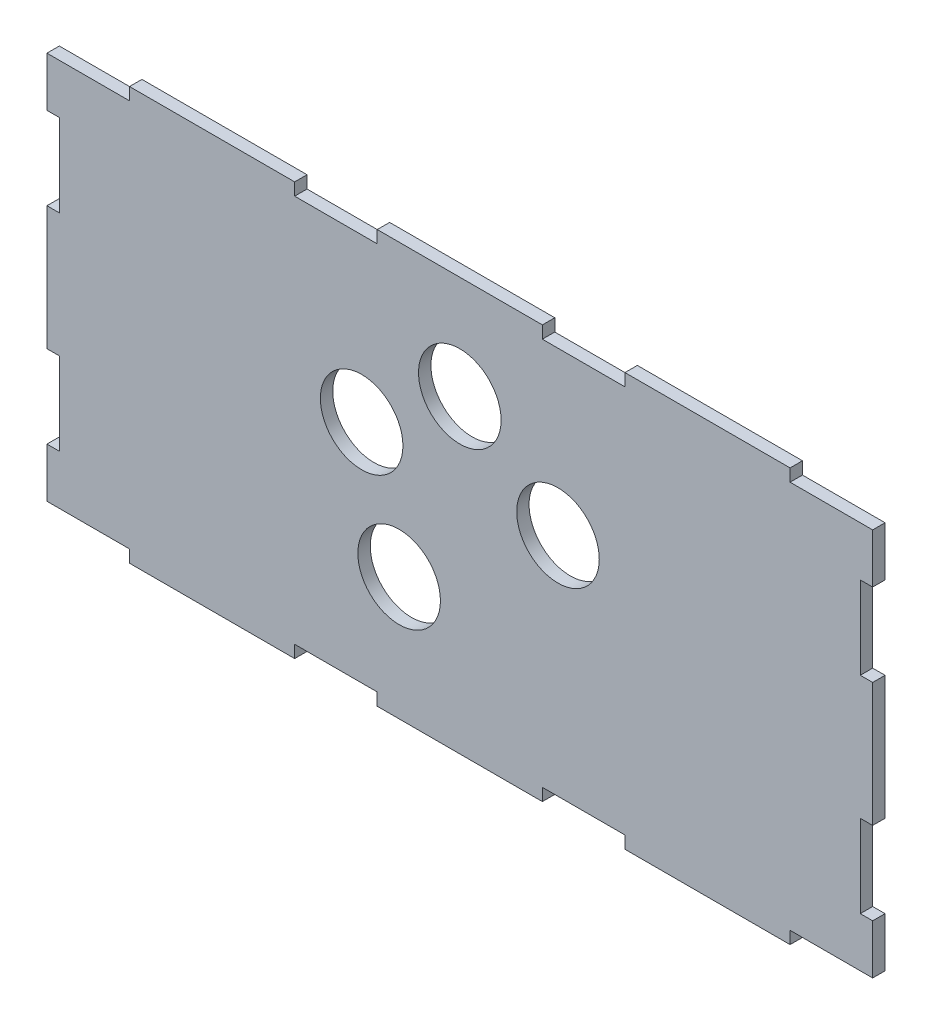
ISO-10303-21;
HEADER;
FILE_DESCRIPTION(('STEP AP214'),'2;1');
FILE_NAME('part.step','',(''),(''),'','','');
FILE_SCHEMA(('AUTOMOTIVE_DESIGN { 1 0 10303 214 1 1 1 1 }'));
ENDSEC;
DATA;
#1=APPLICATION_CONTEXT('core data for automotive mechanical design processes');
#2=APPLICATION_PROTOCOL_DEFINITION('international standard','automotive_design',2000,#1);
#3=PRODUCT_CONTEXT('',#1,'mechanical');
#4=PRODUCT('Part','Part','',(#3));
#5=PRODUCT_RELATED_PRODUCT_CATEGORY('part','',(#4));
#6=PRODUCT_DEFINITION_FORMATION('','',#4);
#7=PRODUCT_DEFINITION_CONTEXT('part definition',#1,'design');
#8=PRODUCT_DEFINITION('design','',#6,#7);
#9=PRODUCT_DEFINITION_SHAPE('','',#8);
#10=(LENGTH_UNIT() NAMED_UNIT(*) SI_UNIT(.MILLI.,.METRE.));
#11=(NAMED_UNIT(*) PLANE_ANGLE_UNIT() SI_UNIT($,.RADIAN.));
#12=(NAMED_UNIT(*) SI_UNIT($,.STERADIAN.) SOLID_ANGLE_UNIT());
#13=UNCERTAINTY_MEASURE_WITH_UNIT(LENGTH_MEASURE(1.E-05),#10,'distance_accuracy_value','');
#14=(GEOMETRIC_REPRESENTATION_CONTEXT(3) GLOBAL_UNCERTAINTY_ASSIGNED_CONTEXT((#13)) GLOBAL_UNIT_ASSIGNED_CONTEXT((#10,
#11,#12)) REPRESENTATION_CONTEXT('',''));
#15=CARTESIAN_POINT('',(0.,0.,0.));
#16=DIRECTION('',(0.,0.,1.));
#17=DIRECTION('',(1.,0.,0.));
#18=AXIS2_PLACEMENT_3D('',#15,#16,#17);
#19=CARTESIAN_POINT('',(-100.,-50.,3.));
#20=DIRECTION('',(1.,0.,0.));
#21=DIRECTION('',(0.,0.,-1.));
#22=AXIS2_PLACEMENT_3D('',#19,#20,#21);
#23=PLANE('',#22);
#24=DIRECTION('',(0.,-1.,0.));
#25=VECTOR('',#24,1.);
#26=CARTESIAN_POINT('',(-100.,-50.,3.));
#27=LINE('',#26,#25);
#28=CARTESIAN_POINT('',(-100.,47.,3.));
#29=VERTEX_POINT('',#28);
#30=CARTESIAN_POINT('',(-100.,35.,3.));
#31=VERTEX_POINT('',#30);
#32=EDGE_CURVE('E344',#29,#31,#27,.T.);
#33=ORIENTED_EDGE('',*,*,#32,.F.);
#34=DIRECTION('',(0.,0.,1.));
#35=VECTOR('',#34,1.);
#36=CARTESIAN_POINT('',(-100.,47.,-7.));
#37=LINE('',#36,#35);
#38=CARTESIAN_POINT('',(-100.,47.,0.));
#39=VERTEX_POINT('',#38);
#40=EDGE_CURVE('E1160',#39,#29,#37,.T.);
#41=ORIENTED_EDGE('',*,*,#40,.F.);
#42=DIRECTION('',(0.,-1.,0.));
#43=VECTOR('',#42,1.);
#44=CARTESIAN_POINT('',(-100.,-50.,0.));
#45=LINE('',#44,#43);
#46=CARTESIAN_POINT('',(-100.,35.,0.));
#47=VERTEX_POINT('',#46);
#48=EDGE_CURVE('E1065',#39,#47,#45,.T.);
#49=ORIENTED_EDGE('',*,*,#48,.T.);
#50=DIRECTION('',(0.,0.,1.));
#51=VECTOR('',#50,1.);
#52=CARTESIAN_POINT('',(-100.,35.,3.));
#53=LINE('',#52,#51);
#54=EDGE_CURVE('E453',#47,#31,#53,.T.);
#55=ORIENTED_EDGE('',*,*,#54,.T.);
#56=EDGE_LOOP('',(#33,#41,#49,#55));
#57=FACE_BOUND('',#56,.T.);
#58=ADVANCED_FACE('F35',(#57),#23,.F.);
#59=CARTESIAN_POINT('',(-100.,15.,3.));
#60=VERTEX_POINT('',#59);
#61=CARTESIAN_POINT('',(-100.,-15.,3.));
#62=VERTEX_POINT('',#61);
#63=EDGE_CURVE('E341',#60,#62,#27,.T.);
#64=ORIENTED_EDGE('',*,*,#63,.F.);
#65=DIRECTION('',(0.,0.,-1.));
#66=VECTOR('',#65,1.);
#67=CARTESIAN_POINT('',(-100.,15.,3.));
#68=LINE('',#67,#66);
#69=CARTESIAN_POINT('',(-100.,15.,0.));
#70=VERTEX_POINT('',#69);
#71=EDGE_CURVE('E451',#60,#70,#68,.T.);
#72=ORIENTED_EDGE('',*,*,#71,.T.);
#73=CARTESIAN_POINT('',(-100.,-15.,0.));
#74=VERTEX_POINT('',#73);
#75=EDGE_CURVE('E1064',#70,#74,#45,.T.);
#76=ORIENTED_EDGE('',*,*,#75,.T.);
#77=DIRECTION('',(0.,0.,1.));
#78=VECTOR('',#77,1.);
#79=CARTESIAN_POINT('',(-100.,-15.,3.));
#80=LINE('',#79,#78);
#81=EDGE_CURVE('E324',#74,#62,#80,.T.);
#82=ORIENTED_EDGE('',*,*,#81,.T.);
#83=EDGE_LOOP('',(#64,#72,#76,#82));
#84=FACE_BOUND('',#83,.T.);
#85=ADVANCED_FACE('F591',(#84),#23,.F.);
#86=CARTESIAN_POINT('',(100.,-50.,3.));
#87=DIRECTION('',(0.,1.,0.));
#88=DIRECTION('',(0.,0.,1.));
#89=AXIS2_PLACEMENT_3D('',#86,#87,#88);
#90=PLANE('',#89);
#91=DIRECTION('',(1.,0.,0.));
#92=VECTOR('',#91,1.);
#93=CARTESIAN_POINT('',(100.,-50.,0.));
#94=LINE('',#93,#92);
#95=CARTESIAN_POINT('',(-20.,-50.,0.));
#96=VERTEX_POINT('',#95);
#97=CARTESIAN_POINT('',(20.,-50.,0.));
#98=VERTEX_POINT('',#97);
#99=EDGE_CURVE('E636',#96,#98,#94,.T.);
#100=ORIENTED_EDGE('',*,*,#99,.T.);
#101=DIRECTION('',(0.,0.,1.));
#102=VECTOR('',#101,1.);
#103=CARTESIAN_POINT('',(20.,-50.,3.));
#104=LINE('',#103,#102);
#105=CARTESIAN_POINT('',(20.,-50.,3.));
#106=VERTEX_POINT('',#105);
#107=EDGE_CURVE('E325',#98,#106,#104,.T.);
#108=ORIENTED_EDGE('',*,*,#107,.T.);
#109=DIRECTION('',(1.,0.,0.));
#110=VECTOR('',#109,1.);
#111=CARTESIAN_POINT('',(100.,-50.,3.));
#112=LINE('',#111,#110);
#113=CARTESIAN_POINT('',(-20.,-50.,3.));
#114=VERTEX_POINT('',#113);
#115=EDGE_CURVE('E359',#114,#106,#112,.T.);
#116=ORIENTED_EDGE('',*,*,#115,.F.);
#117=DIRECTION('',(0.,0.,-1.));
#118=VECTOR('',#117,1.);
#119=CARTESIAN_POINT('',(-20.,-50.,3.));
#120=LINE('',#119,#118);
#121=EDGE_CURVE('E435',#114,#96,#120,.T.);
#122=ORIENTED_EDGE('',*,*,#121,.T.);
#123=EDGE_LOOP('',(#100,#108,#116,#122));
#124=FACE_BOUND('',#123,.T.);
#125=ADVANCED_FACE('F596',(#124),#90,.F.);
#126=CARTESIAN_POINT('',(-80.,-50.,3.));
#127=VERTEX_POINT('',#126);
#128=CARTESIAN_POINT('',(-40.,-50.,3.));
#129=VERTEX_POINT('',#128);
#130=EDGE_CURVE('E360',#127,#129,#112,.T.);
#131=ORIENTED_EDGE('',*,*,#130,.F.);
#132=DIRECTION('',(0.,0.,-1.));
#133=VECTOR('',#132,1.);
#134=CARTESIAN_POINT('',(-80.,-50.,3.));
#135=LINE('',#134,#133);
#136=CARTESIAN_POINT('',(-80.,-50.,0.));
#137=VERTEX_POINT('',#136);
#138=EDGE_CURVE('E441',#127,#137,#135,.T.);
#139=ORIENTED_EDGE('',*,*,#138,.T.);
#140=CARTESIAN_POINT('',(-40.,-50.,0.));
#141=VERTEX_POINT('',#140);
#142=EDGE_CURVE('E632',#137,#141,#94,.T.);
#143=ORIENTED_EDGE('',*,*,#142,.T.);
#144=DIRECTION('',(0.,0.,1.));
#145=VECTOR('',#144,1.);
#146=CARTESIAN_POINT('',(-40.,-50.,3.));
#147=LINE('',#146,#145);
#148=EDGE_CURVE('E438',#141,#129,#147,.T.);
#149=ORIENTED_EDGE('',*,*,#148,.T.);
#150=EDGE_LOOP('',(#131,#139,#143,#149));
#151=FACE_BOUND('',#150,.T.);
#152=ADVANCED_FACE('F605',(#151),#90,.F.);
#153=CARTESIAN_POINT('',(100.,50.,3.));
#154=DIRECTION('',(-1.,0.,0.));
#155=DIRECTION('',(0.,0.,1.));
#156=AXIS2_PLACEMENT_3D('',#153,#154,#155);
#157=PLANE('',#156);
#158=DIRECTION('',(0.,1.,0.));
#159=VECTOR('',#158,1.);
#160=CARTESIAN_POINT('',(100.,50.,3.));
#161=LINE('',#160,#159);
#162=CARTESIAN_POINT('',(100.,-15.,3.));
#163=VERTEX_POINT('',#162);
#164=CARTESIAN_POINT('',(100.,15.,3.));
#165=VERTEX_POINT('',#164);
#166=EDGE_CURVE('E373',#163,#165,#161,.T.);
#167=ORIENTED_EDGE('',*,*,#166,.F.);
#168=DIRECTION('',(0.,0.,-1.));
#169=VECTOR('',#168,1.);
#170=CARTESIAN_POINT('',(100.,-15.,3.));
#171=LINE('',#170,#169);
#172=CARTESIAN_POINT('',(100.,-15.,0.));
#173=VERTEX_POINT('',#172);
#174=EDGE_CURVE('E429',#163,#173,#171,.T.);
#175=ORIENTED_EDGE('',*,*,#174,.T.);
#176=DIRECTION('',(0.,1.,0.));
#177=VECTOR('',#176,1.);
#178=CARTESIAN_POINT('',(100.,50.,0.));
#179=LINE('',#178,#177);
#180=CARTESIAN_POINT('',(100.,15.,0.));
#181=VERTEX_POINT('',#180);
#182=EDGE_CURVE('E631',#173,#181,#179,.T.);
#183=ORIENTED_EDGE('',*,*,#182,.T.);
#184=DIRECTION('',(0.,0.,1.));
#185=VECTOR('',#184,1.);
#186=CARTESIAN_POINT('',(100.,15.,3.));
#187=LINE('',#186,#185);
#188=EDGE_CURVE('E420',#181,#165,#187,.T.);
#189=ORIENTED_EDGE('',*,*,#188,.T.);
#190=EDGE_LOOP('',(#167,#175,#183,#189));
#191=FACE_BOUND('',#190,.T.);
#192=ADVANCED_FACE('F613',(#191),#157,.F.);
#193=CARTESIAN_POINT('',(100.,35.,0.));
#194=VERTEX_POINT('',#193);
#195=CARTESIAN_POINT('',(100.,47.,0.));
#196=VERTEX_POINT('',#195);
#197=EDGE_CURVE('E627',#194,#196,#179,.T.);
#198=ORIENTED_EDGE('',*,*,#197,.T.);
#199=DIRECTION('',(0.,0.,1.));
#200=VECTOR('',#199,1.);
#201=CARTESIAN_POINT('',(100.,47.,-7.));
#202=LINE('',#201,#200);
#203=CARTESIAN_POINT('',(100.,47.,3.));
#204=VERTEX_POINT('',#203);
#205=EDGE_CURVE('E628',#196,#204,#202,.T.);
#206=ORIENTED_EDGE('',*,*,#205,.T.);
#207=CARTESIAN_POINT('',(100.,35.,3.));
#208=VERTEX_POINT('',#207);
#209=EDGE_CURVE('E368',#208,#204,#161,.T.);
#210=ORIENTED_EDGE('',*,*,#209,.F.);
#211=DIRECTION('',(0.,0.,-1.));
#212=VECTOR('',#211,1.);
#213=CARTESIAN_POINT('',(100.,35.,3.));
#214=LINE('',#213,#212);
#215=EDGE_CURVE('E423',#208,#194,#214,.T.);
#216=ORIENTED_EDGE('',*,*,#215,.T.);
#217=EDGE_LOOP('',(#198,#206,#210,#216));
#218=FACE_BOUND('',#217,.T.);
#219=ADVANCED_FACE('F614',(#218),#157,.F.);
#220=CARTESIAN_POINT('',(-100.,50.,3.));
#221=DIRECTION('',(0.,-1.,0.));
#222=DIRECTION('',(1.,0.,0.));
#223=AXIS2_PLACEMENT_3D('',#220,#221,#222);
#224=PLANE('',#223);
#225=DIRECTION('',(-1.,0.,0.));
#226=VECTOR('',#225,1.);
#227=CARTESIAN_POINT('',(-100.,50.,0.));
#228=LINE('',#227,#226);
#229=CARTESIAN_POINT('',(80.,50.,0.));
#230=VERTEX_POINT('',#229);
#231=CARTESIAN_POINT('',(40.,50.,0.));
#232=VERTEX_POINT('',#231);
#233=EDGE_CURVE('E342',#230,#232,#228,.T.);
#234=ORIENTED_EDGE('',*,*,#233,.T.);
#235=DIRECTION('',(0.,0.,1.));
#236=VECTOR('',#235,1.);
#237=CARTESIAN_POINT('',(40.,50.,3.));
#238=LINE('',#237,#236);
#239=CARTESIAN_POINT('',(40.,50.,3.));
#240=VERTEX_POINT('',#239);
#241=EDGE_CURVE('E414',#232,#240,#238,.T.);
#242=ORIENTED_EDGE('',*,*,#241,.T.);
#243=DIRECTION('',(-1.,0.,0.));
#244=VECTOR('',#243,1.);
#245=CARTESIAN_POINT('',(-100.,50.,3.));
#246=LINE('',#245,#244);
#247=CARTESIAN_POINT('',(80.,50.,3.));
#248=VERTEX_POINT('',#247);
#249=EDGE_CURVE('E387',#248,#240,#246,.T.);
#250=ORIENTED_EDGE('',*,*,#249,.F.);
#251=DIRECTION('',(0.,0.,-1.));
#252=VECTOR('',#251,1.);
#253=CARTESIAN_POINT('',(80.,50.,3.));
#254=LINE('',#253,#252);
#255=EDGE_CURVE('E395',#248,#230,#254,.T.);
#256=ORIENTED_EDGE('',*,*,#255,.T.);
#257=EDGE_LOOP('',(#234,#242,#250,#256));
#258=FACE_BOUND('',#257,.T.);
#259=ADVANCED_FACE('F587',(#258),#224,.F.);
#260=CARTESIAN_POINT('',(20.,50.,3.));
#261=VERTEX_POINT('',#260);
#262=CARTESIAN_POINT('',(-20.,50.,3.));
#263=VERTEX_POINT('',#262);
#264=EDGE_CURVE('E386',#261,#263,#246,.T.);
#265=ORIENTED_EDGE('',*,*,#264,.F.);
#266=DIRECTION('',(0.,0.,-1.));
#267=VECTOR('',#266,1.);
#268=CARTESIAN_POINT('',(20.,50.,3.));
#269=LINE('',#268,#267);
#270=CARTESIAN_POINT('',(20.,50.,0.));
#271=VERTEX_POINT('',#270);
#272=EDGE_CURVE('E411',#261,#271,#269,.T.);
#273=ORIENTED_EDGE('',*,*,#272,.T.);
#274=CARTESIAN_POINT('',(-20.,50.,0.));
#275=VERTEX_POINT('',#274);
#276=EDGE_CURVE('E347',#271,#275,#228,.T.);
#277=ORIENTED_EDGE('',*,*,#276,.T.);
#278=DIRECTION('',(0.,0.,1.));
#279=VECTOR('',#278,1.);
#280=CARTESIAN_POINT('',(-20.,50.,3.));
#281=LINE('',#280,#279);
#282=EDGE_CURVE('E405',#275,#263,#281,.T.);
#283=ORIENTED_EDGE('',*,*,#282,.T.);
#284=EDGE_LOOP('',(#265,#273,#277,#283));
#285=FACE_BOUND('',#284,.T.);
#286=ADVANCED_FACE('F588',(#285),#224,.F.);
#287=CARTESIAN_POINT('',(0.,0.,3.));
#288=DIRECTION('',(0.,0.,-1.));
#289=DIRECTION('',(-1.,0.,0.));
#290=AXIS2_PLACEMENT_3D('',#287,#288,#289);
#291=PLANE('',#290);
#292=CARTESIAN_POINT('',(-40.,50.,3.));
#293=VERTEX_POINT('',#292);
#294=CARTESIAN_POINT('',(-80.,50.,3.));
#295=VERTEX_POINT('',#294);
#296=EDGE_CURVE('E382',#293,#295,#246,.T.);
#297=ORIENTED_EDGE('',*,*,#296,.T.);
#298=DIRECTION('',(0.,1.,0.));
#299=VECTOR('',#298,1.);
#300=CARTESIAN_POINT('',(-80.,47.,3.));
#301=LINE('',#300,#299);
#302=CARTESIAN_POINT('',(-80.,47.,3.));
#303=VERTEX_POINT('',#302);
#304=EDGE_CURVE('E1164',#303,#295,#301,.T.);
#305=ORIENTED_EDGE('',*,*,#304,.F.);
#306=DIRECTION('',(1.,0.,0.));
#307=VECTOR('',#306,1.);
#308=CARTESIAN_POINT('',(-100.,47.,3.));
#309=LINE('',#308,#307);
#310=EDGE_CURVE('E1186',#29,#303,#309,.T.);
#311=ORIENTED_EDGE('',*,*,#310,.F.);
#312=ORIENTED_EDGE('',*,*,#32,.T.);
#313=DIRECTION('',(-1.,0.,0.));
#314=VECTOR('',#313,1.);
#315=CARTESIAN_POINT('',(-100.,35.,3.));
#316=LINE('',#315,#314);
#317=CARTESIAN_POINT('',(-97.,35.,3.));
#318=VERTEX_POINT('',#317);
#319=EDGE_CURVE('E1209',#318,#31,#316,.T.);
#320=ORIENTED_EDGE('',*,*,#319,.F.);
#321=DIRECTION('',(0.,1.,0.));
#322=VECTOR('',#321,1.);
#323=CARTESIAN_POINT('',(-97.,35.,3.));
#324=LINE('',#323,#322);
#325=CARTESIAN_POINT('',(-97.,15.,3.));
#326=VERTEX_POINT('',#325);
#327=EDGE_CURVE('E674',#326,#318,#324,.T.);
#328=ORIENTED_EDGE('',*,*,#327,.F.);
#329=DIRECTION('',(1.,0.,0.));
#330=VECTOR('',#329,1.);
#331=CARTESIAN_POINT('',(-97.,15.,3.));
#332=LINE('',#331,#330);
#333=EDGE_CURVE('E670',#60,#326,#332,.T.);
#334=ORIENTED_EDGE('',*,*,#333,.F.);
#335=ORIENTED_EDGE('',*,*,#63,.T.);
#336=DIRECTION('',(-1.,0.,0.));
#337=VECTOR('',#336,1.);
#338=CARTESIAN_POINT('',(-100.,-15.,3.));
#339=LINE('',#338,#337);
#340=CARTESIAN_POINT('',(-97.,-15.,3.));
#341=VERTEX_POINT('',#340);
#342=EDGE_CURVE('E687',#341,#62,#339,.T.);
#343=ORIENTED_EDGE('',*,*,#342,.F.);
#344=DIRECTION('',(0.,1.,0.));
#345=VECTOR('',#344,1.);
#346=CARTESIAN_POINT('',(-97.,-15.,3.));
#347=LINE('',#346,#345);
#348=CARTESIAN_POINT('',(-97.,-35.,3.));
#349=VERTEX_POINT('',#348);
#350=EDGE_CURVE('E336',#349,#341,#347,.T.);
#351=ORIENTED_EDGE('',*,*,#350,.F.);
#352=DIRECTION('',(1.,0.,0.));
#353=VECTOR('',#352,1.);
#354=CARTESIAN_POINT('',(-97.,-35.,3.));
#355=LINE('',#354,#353);
#356=CARTESIAN_POINT('',(-100.,-35.,3.));
#357=VERTEX_POINT('',#356);
#358=EDGE_CURVE('E318',#357,#349,#355,.T.);
#359=ORIENTED_EDGE('',*,*,#358,.F.);
#360=CARTESIAN_POINT('',(-100.,-47.,3.));
#361=VERTEX_POINT('',#360);
#362=EDGE_CURVE('E333',#357,#361,#27,.T.);
#363=ORIENTED_EDGE('',*,*,#362,.T.);
#364=DIRECTION('',(-1.,0.,0.));
#365=VECTOR('',#364,1.);
#366=CARTESIAN_POINT('',(-100.,-47.,3.));
#367=LINE('',#366,#365);
#368=CARTESIAN_POINT('',(-80.,-47.,3.));
#369=VERTEX_POINT('',#368);
#370=EDGE_CURVE('E1133',#369,#361,#367,.T.);
#371=ORIENTED_EDGE('',*,*,#370,.F.);
#372=DIRECTION('',(0.,1.,0.));
#373=VECTOR('',#372,1.);
#374=CARTESIAN_POINT('',(-80.,-47.,3.));
#375=LINE('',#374,#373);
#376=EDGE_CURVE('E1138',#127,#369,#375,.T.);
#377=ORIENTED_EDGE('',*,*,#376,.F.);
#378=ORIENTED_EDGE('',*,*,#130,.T.);
#379=DIRECTION('',(0.,-1.,0.));
#380=VECTOR('',#379,1.);
#381=CARTESIAN_POINT('',(-40.,-50.,3.));
#382=LINE('',#381,#380);
#383=CARTESIAN_POINT('',(-40.,-47.,3.));
#384=VERTEX_POINT('',#383);
#385=EDGE_CURVE('E1145',#384,#129,#382,.T.);
#386=ORIENTED_EDGE('',*,*,#385,.F.);
#387=DIRECTION('',(-1.,0.,0.));
#388=VECTOR('',#387,1.);
#389=CARTESIAN_POINT('',(-40.,-47.,3.));
#390=LINE('',#389,#388);
#391=CARTESIAN_POINT('',(-20.,-47.,3.));
#392=VERTEX_POINT('',#391);
#393=EDGE_CURVE('E1105',#392,#384,#390,.T.);
#394=ORIENTED_EDGE('',*,*,#393,.F.);
#395=DIRECTION('',(0.,1.,0.));
#396=VECTOR('',#395,1.);
#397=CARTESIAN_POINT('',(-20.,-47.,3.));
#398=LINE('',#397,#396);
#399=EDGE_CURVE('E1101',#114,#392,#398,.T.);
#400=ORIENTED_EDGE('',*,*,#399,.F.);
#401=ORIENTED_EDGE('',*,*,#115,.T.);
#402=DIRECTION('',(0.,-1.,0.));
#403=VECTOR('',#402,1.);
#404=CARTESIAN_POINT('',(20.,-50.,3.));
#405=LINE('',#404,#403);
#406=CARTESIAN_POINT('',(20.,-47.,3.));
#407=VERTEX_POINT('',#406);
#408=EDGE_CURVE('E1095',#407,#106,#405,.T.);
#409=ORIENTED_EDGE('',*,*,#408,.F.);
#410=DIRECTION('',(-1.,0.,0.));
#411=VECTOR('',#410,1.);
#412=CARTESIAN_POINT('',(20.,-47.,3.));
#413=LINE('',#412,#411);
#414=CARTESIAN_POINT('',(40.,-47.,3.));
#415=VERTEX_POINT('',#414);
#416=EDGE_CURVE('E1087',#415,#407,#413,.T.);
#417=ORIENTED_EDGE('',*,*,#416,.F.);
#418=DIRECTION('',(0.,1.,0.));
#419=VECTOR('',#418,1.);
#420=CARTESIAN_POINT('',(40.,-47.,3.));
#421=LINE('',#420,#419);
#422=CARTESIAN_POINT('',(40.,-50.,3.));
#423=VERTEX_POINT('',#422);
#424=EDGE_CURVE('E1119',#423,#415,#421,.T.);
#425=ORIENTED_EDGE('',*,*,#424,.F.);
#426=CARTESIAN_POINT('',(80.,-50.,3.));
#427=VERTEX_POINT('',#426);
#428=EDGE_CURVE('E354',#423,#427,#112,.T.);
#429=ORIENTED_EDGE('',*,*,#428,.T.);
#430=DIRECTION('',(0.,-1.,0.));
#431=VECTOR('',#430,1.);
#432=CARTESIAN_POINT('',(80.,-50.,3.));
#433=LINE('',#432,#431);
#434=CARTESIAN_POINT('',(80.,-47.,3.));
#435=VERTEX_POINT('',#434);
#436=EDGE_CURVE('E1093',#435,#427,#433,.T.);
#437=ORIENTED_EDGE('',*,*,#436,.F.);
#438=DIRECTION('',(-1.,0.,0.));
#439=VECTOR('',#438,1.);
#440=CARTESIAN_POINT('',(80.,-47.,3.));
#441=LINE('',#440,#439);
#442=CARTESIAN_POINT('',(100.,-47.,3.));
#443=VERTEX_POINT('',#442);
#444=EDGE_CURVE('E1089',#443,#435,#441,.T.);
#445=ORIENTED_EDGE('',*,*,#444,.F.);
#446=CARTESIAN_POINT('',(100.,-35.,3.));
#447=VERTEX_POINT('',#446);
#448=EDGE_CURVE('E374',#443,#447,#161,.T.);
#449=ORIENTED_EDGE('',*,*,#448,.T.);
#450=DIRECTION('',(1.,0.,0.));
#451=VECTOR('',#450,1.);
#452=CARTESIAN_POINT('',(97.,-35.,3.));
#453=LINE('',#452,#451);
#454=CARTESIAN_POINT('',(97.,-35.,3.));
#455=VERTEX_POINT('',#454);
#456=EDGE_CURVE('E698',#455,#447,#453,.T.);
#457=ORIENTED_EDGE('',*,*,#456,.F.);
#458=DIRECTION('',(0.,-1.,0.));
#459=VECTOR('',#458,1.);
#460=CARTESIAN_POINT('',(97.,-15.,3.));
#461=LINE('',#460,#459);
#462=CARTESIAN_POINT('',(97.,-15.,3.));
#463=VERTEX_POINT('',#462);
#464=EDGE_CURVE('E694',#463,#455,#461,.T.);
#465=ORIENTED_EDGE('',*,*,#464,.F.);
#466=DIRECTION('',(-1.,0.,0.));
#467=VECTOR('',#466,1.);
#468=CARTESIAN_POINT('',(100.,-15.,3.));
#469=LINE('',#468,#467);
#470=EDGE_CURVE('E708',#163,#463,#469,.T.);
#471=ORIENTED_EDGE('',*,*,#470,.F.);
#472=ORIENTED_EDGE('',*,*,#166,.T.);
#473=DIRECTION('',(1.,0.,0.));
#474=VECTOR('',#473,1.);
#475=CARTESIAN_POINT('',(97.,15.,3.));
#476=LINE('',#475,#474);
#477=CARTESIAN_POINT('',(97.,15.,3.));
#478=VERTEX_POINT('',#477);
#479=EDGE_CURVE('E719',#478,#165,#476,.T.);
#480=ORIENTED_EDGE('',*,*,#479,.F.);
#481=DIRECTION('',(0.,-1.,0.));
#482=VECTOR('',#481,1.);
#483=CARTESIAN_POINT('',(97.,35.,3.));
#484=LINE('',#483,#482);
#485=CARTESIAN_POINT('',(97.,35.,3.));
#486=VERTEX_POINT('',#485);
#487=EDGE_CURVE('E715',#486,#478,#484,.T.);
#488=ORIENTED_EDGE('',*,*,#487,.F.);
#489=DIRECTION('',(-1.,0.,0.));
#490=VECTOR('',#489,1.);
#491=CARTESIAN_POINT('',(100.,35.,3.));
#492=LINE('',#491,#490);
#493=EDGE_CURVE('E726',#208,#486,#492,.T.);
#494=ORIENTED_EDGE('',*,*,#493,.F.);
#495=ORIENTED_EDGE('',*,*,#209,.T.);
#496=DIRECTION('',(1.,0.,0.));
#497=VECTOR('',#496,1.);
#498=CARTESIAN_POINT('',(80.,47.,3.));
#499=LINE('',#498,#497);
#500=CARTESIAN_POINT('',(80.,47.,3.));
#501=VERTEX_POINT('',#500);
#502=EDGE_CURVE('E1191',#501,#204,#499,.T.);
#503=ORIENTED_EDGE('',*,*,#502,.F.);
#504=DIRECTION('',(0.,-1.,0.));
#505=VECTOR('',#504,1.);
#506=CARTESIAN_POINT('',(80.,50.,3.));
#507=LINE('',#506,#505);
#508=EDGE_CURVE('E1135',#248,#501,#507,.T.);
#509=ORIENTED_EDGE('',*,*,#508,.F.);
#510=ORIENTED_EDGE('',*,*,#249,.T.);
#511=DIRECTION('',(0.,1.,0.));
#512=VECTOR('',#511,1.);
#513=CARTESIAN_POINT('',(40.,47.,3.));
#514=LINE('',#513,#512);
#515=CARTESIAN_POINT('',(40.,47.,3.));
#516=VERTEX_POINT('',#515);
#517=EDGE_CURVE('E668',#516,#240,#514,.T.);
#518=ORIENTED_EDGE('',*,*,#517,.F.);
#519=DIRECTION('',(1.,0.,0.));
#520=VECTOR('',#519,1.);
#521=CARTESIAN_POINT('',(20.,47.,3.));
#522=LINE('',#521,#520);
#523=CARTESIAN_POINT('',(20.,47.,3.));
#524=VERTEX_POINT('',#523);
#525=EDGE_CURVE('E1179',#524,#516,#522,.T.);
#526=ORIENTED_EDGE('',*,*,#525,.F.);
#527=DIRECTION('',(0.,-1.,0.));
#528=VECTOR('',#527,1.);
#529=CARTESIAN_POINT('',(20.,50.,3.));
#530=LINE('',#529,#528);
#531=EDGE_CURVE('E1172',#261,#524,#530,.T.);
#532=ORIENTED_EDGE('',*,*,#531,.F.);
#533=ORIENTED_EDGE('',*,*,#264,.T.);
#534=DIRECTION('',(0.,1.,0.));
#535=VECTOR('',#534,1.);
#536=CARTESIAN_POINT('',(-20.,47.,3.));
#537=LINE('',#536,#535);
#538=CARTESIAN_POINT('',(-20.,47.,3.));
#539=VERTEX_POINT('',#538);
#540=EDGE_CURVE('E650',#539,#263,#537,.T.);
#541=ORIENTED_EDGE('',*,*,#540,.F.);
#542=DIRECTION('',(1.,0.,0.));
#543=VECTOR('',#542,1.);
#544=CARTESIAN_POINT('',(-40.,47.,3.));
#545=LINE('',#544,#543);
#546=CARTESIAN_POINT('',(-40.,47.,3.));
#547=VERTEX_POINT('',#546);
#548=EDGE_CURVE('E484',#547,#539,#545,.T.);
#549=ORIENTED_EDGE('',*,*,#548,.F.);
#550=DIRECTION('',(0.,-1.,0.));
#551=VECTOR('',#550,1.);
#552=CARTESIAN_POINT('',(-40.,50.,3.));
#553=LINE('',#552,#551);
#554=EDGE_CURVE('E482',#293,#547,#553,.T.);
#555=ORIENTED_EDGE('',*,*,#554,.F.);
#556=EDGE_LOOP('',(#297,#305,#311,#312,#320,#328,#334,#335,#343,#351,#359,#363,#371,#377,#378,
#386,#394,#400,#401,#409,#417,#425,#429,#437,#445,#449,#457,#465,#471,#472,#480,#488,#494,#495,
#503,#509,#510,#518,#526,#532,#533,#541,#549,#555));
#557=FACE_BOUND('',#556,.T.);
#558=CARTESIAN_POINT('',(0.,25.,3.));
#559=DIRECTION('',(0.,0.,1.));
#560=DIRECTION('',(1.,0.,0.));
#561=AXIS2_PLACEMENT_3D('',#558,#559,#560);
#562=CIRCLE('',#561,10.);
#563=CARTESIAN_POINT('',(10.,25.,3.));
#564=VERTEX_POINT('',#563);
#565=EDGE_CURVE('E562',#564,#564,#562,.T.);
#566=ORIENTED_EDGE('',*,*,#565,.F.);
#567=EDGE_LOOP('',(#566));
#568=FACE_BOUND('',#567,.T.);
#569=CARTESIAN_POINT('',(23.7764129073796,7.7254248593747,3.));
#570=DIRECTION('',(0.,0.,1.));
#571=DIRECTION('',(1.,0.,0.));
#572=AXIS2_PLACEMENT_3D('',#569,#570,#571);
#573=CIRCLE('',#572,10.);
#574=CARTESIAN_POINT('',(33.7764129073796,7.7254248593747,3.));
#575=VERTEX_POINT('',#574);
#576=EDGE_CURVE('E556',#575,#575,#573,.T.);
#577=ORIENTED_EDGE('',*,*,#576,.F.);
#578=EDGE_LOOP('',(#577));
#579=FACE_BOUND('',#578,.T.);
#580=CARTESIAN_POINT('',(-14.6946313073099,-20.2254248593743,3.));
#581=DIRECTION('',(0.,0.,1.));
#582=DIRECTION('',(1.,0.,0.));
#583=AXIS2_PLACEMENT_3D('',#580,#581,#582);
#584=CIRCLE('',#583,10.);
#585=CARTESIAN_POINT('',(-4.69463130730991,-20.2254248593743,3.));
#586=VERTEX_POINT('',#585);
#587=EDGE_CURVE('E546',#586,#586,#584,.T.);
#588=ORIENTED_EDGE('',*,*,#587,.F.);
#589=EDGE_LOOP('',(#588));
#590=FACE_BOUND('',#589,.T.);
#591=CARTESIAN_POINT('',(-23.7764129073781,7.72542485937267,3.));
#592=DIRECTION('',(0.,0.,1.));
#593=DIRECTION('',(1.,0.,0.));
#594=AXIS2_PLACEMENT_3D('',#591,#592,#593);
#595=CIRCLE('',#594,10.);
#596=CARTESIAN_POINT('',(-13.7764129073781,7.72542485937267,3.));
#597=VERTEX_POINT('',#596);
#598=EDGE_CURVE('E539',#597,#597,#595,.T.);
#599=ORIENTED_EDGE('',*,*,#598,.F.);
#600=EDGE_LOOP('',(#599));
#601=FACE_BOUND('',#600,.T.);
#602=ADVANCED_FACE('F330',(#557,#568,#579,#590,#601),#291,.F.);
#603=CARTESIAN_POINT('',(0.,0.,0.));
#604=DIRECTION('',(0.,0.,-1.));
#605=DIRECTION('',(-1.,0.,0.));
#606=AXIS2_PLACEMENT_3D('',#603,#604,#605);
#607=PLANE('',#606);
#608=DIRECTION('',(0.,-1.,0.));
#609=VECTOR('',#608,1.);
#610=CARTESIAN_POINT('',(-80.,0.,0.));
#611=LINE('',#610,#609);
#612=CARTESIAN_POINT('',(-80.,50.,0.));
#613=VERTEX_POINT('',#612);
#614=CARTESIAN_POINT('',(-80.,47.,0.));
#615=VERTEX_POINT('',#614);
#616=EDGE_CURVE('E503',#613,#615,#611,.T.);
#617=ORIENTED_EDGE('',*,*,#616,.F.);
#618=CARTESIAN_POINT('',(-40.,50.,0.));
#619=VERTEX_POINT('',#618);
#620=EDGE_CURVE('E349',#619,#613,#228,.T.);
#621=ORIENTED_EDGE('',*,*,#620,.F.);
#622=DIRECTION('',(0.,1.,0.));
#623=VECTOR('',#622,1.);
#624=CARTESIAN_POINT('',(-40.,0.,0.));
#625=LINE('',#624,#623);
#626=CARTESIAN_POINT('',(-40.,47.,0.));
#627=VERTEX_POINT('',#626);
#628=EDGE_CURVE('E481',#627,#619,#625,.T.);
#629=ORIENTED_EDGE('',*,*,#628,.F.);
#630=DIRECTION('',(-1.,0.,0.));
#631=VECTOR('',#630,1.);
#632=CARTESIAN_POINT('',(0.,47.,0.));
#633=LINE('',#632,#631);
#634=CARTESIAN_POINT('',(-20.,47.,0.));
#635=VERTEX_POINT('',#634);
#636=EDGE_CURVE('E43',#635,#627,#633,.T.);
#637=ORIENTED_EDGE('',*,*,#636,.F.);
#638=DIRECTION('',(0.,-1.,0.));
#639=VECTOR('',#638,1.);
#640=CARTESIAN_POINT('',(-20.,0.,0.));
#641=LINE('',#640,#639);
#642=EDGE_CURVE('E491',#275,#635,#641,.T.);
#643=ORIENTED_EDGE('',*,*,#642,.F.);
#644=ORIENTED_EDGE('',*,*,#276,.F.);
#645=DIRECTION('',(0.,1.,0.));
#646=VECTOR('',#645,1.);
#647=CARTESIAN_POINT('',(20.,0.,0.));
#648=LINE('',#647,#646);
#649=CARTESIAN_POINT('',(20.,47.,0.));
#650=VERTEX_POINT('',#649);
#651=EDGE_CURVE('E494',#650,#271,#648,.T.);
#652=ORIENTED_EDGE('',*,*,#651,.F.);
#653=DIRECTION('',(-1.,0.,0.));
#654=VECTOR('',#653,1.);
#655=CARTESIAN_POINT('',(0.,47.,0.));
#656=LINE('',#655,#654);
#657=CARTESIAN_POINT('',(40.,47.,0.));
#658=VERTEX_POINT('',#657);
#659=EDGE_CURVE('E12',#658,#650,#656,.T.);
#660=ORIENTED_EDGE('',*,*,#659,.F.);
#661=DIRECTION('',(0.,-1.,0.));
#662=VECTOR('',#661,1.);
#663=CARTESIAN_POINT('',(40.0000000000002,1.8503717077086E-13,0.));
#664=LINE('',#663,#662);
#665=EDGE_CURVE('E501',#232,#658,#664,.T.);
#666=ORIENTED_EDGE('',*,*,#665,.F.);
#667=ORIENTED_EDGE('',*,*,#233,.F.);
#668=DIRECTION('',(0.,1.,0.));
#669=VECTOR('',#668,1.);
#670=CARTESIAN_POINT('',(80.,0.,0.));
#671=LINE('',#670,#669);
#672=CARTESIAN_POINT('',(80.,47.,0.));
#673=VERTEX_POINT('',#672);
#674=EDGE_CURVE('E492',#673,#230,#671,.T.);
#675=ORIENTED_EDGE('',*,*,#674,.F.);
#676=DIRECTION('',(-1.,0.,0.));
#677=VECTOR('',#676,1.);
#678=CARTESIAN_POINT('',(0.,47.,0.));
#679=LINE('',#678,#677);
#680=EDGE_CURVE('E513',#196,#673,#679,.T.);
#681=ORIENTED_EDGE('',*,*,#680,.F.);
#682=ORIENTED_EDGE('',*,*,#197,.F.);
#683=DIRECTION('',(1.,0.,0.));
#684=VECTOR('',#683,1.);
#685=CARTESIAN_POINT('',(-1.619075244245E-13,34.9999999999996,0.));
#686=LINE('',#685,#684);
#687=CARTESIAN_POINT('',(97.,35.,0.));
#688=VERTEX_POINT('',#687);
#689=EDGE_CURVE('E507',#688,#194,#686,.T.);
#690=ORIENTED_EDGE('',*,*,#689,.F.);
#691=DIRECTION('',(0.,1.,0.));
#692=VECTOR('',#691,1.);
#693=CARTESIAN_POINT('',(97.,0.,0.));
#694=LINE('',#693,#692);
#695=CARTESIAN_POINT('',(97.,15.,0.));
#696=VERTEX_POINT('',#695);
#697=EDGE_CURVE('E458',#696,#688,#694,.T.);
#698=ORIENTED_EDGE('',*,*,#697,.F.);
#699=DIRECTION('',(-1.,0.,0.));
#700=VECTOR('',#699,1.);
#701=CARTESIAN_POINT('',(0.,15.0000000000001,0.));
#702=LINE('',#701,#700);
#703=EDGE_CURVE('E505',#181,#696,#702,.T.);
#704=ORIENTED_EDGE('',*,*,#703,.F.);
#705=ORIENTED_EDGE('',*,*,#182,.F.);
#706=DIRECTION('',(1.,0.,0.));
#707=VECTOR('',#706,1.);
#708=CARTESIAN_POINT('',(0.,-15.,0.));
#709=LINE('',#708,#707);
#710=CARTESIAN_POINT('',(97.,-15.,0.));
#711=VERTEX_POINT('',#710);
#712=EDGE_CURVE('E511',#711,#173,#709,.T.);
#713=ORIENTED_EDGE('',*,*,#712,.F.);
#714=DIRECTION('',(0.,1.,0.));
#715=VECTOR('',#714,1.);
#716=CARTESIAN_POINT('',(97.,0.,0.));
#717=LINE('',#716,#715);
#718=CARTESIAN_POINT('',(97.,-35.,0.));
#719=VERTEX_POINT('',#718);
#720=EDGE_CURVE('E460',#719,#711,#717,.T.);
#721=ORIENTED_EDGE('',*,*,#720,.F.);
#722=DIRECTION('',(-1.,0.,0.));
#723=VECTOR('',#722,1.);
#724=CARTESIAN_POINT('',(0.,-35.0000000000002,0.));
#725=LINE('',#724,#723);
#726=CARTESIAN_POINT('',(100.,-35.,0.));
#727=VERTEX_POINT('',#726);
#728=EDGE_CURVE('E509',#727,#719,#725,.T.);
#729=ORIENTED_EDGE('',*,*,#728,.F.);
#730=CARTESIAN_POINT('',(100.,-47.,0.));
#731=VERTEX_POINT('',#730);
#732=EDGE_CURVE('E633',#731,#727,#179,.T.);
#733=ORIENTED_EDGE('',*,*,#732,.F.);
#734=DIRECTION('',(1.,0.,0.));
#735=VECTOR('',#734,1.);
#736=CARTESIAN_POINT('',(0.,-47.,0.));
#737=LINE('',#736,#735);
#738=CARTESIAN_POINT('',(80.,-47.,0.));
#739=VERTEX_POINT('',#738);
#740=EDGE_CURVE('E515',#739,#731,#737,.T.);
#741=ORIENTED_EDGE('',*,*,#740,.F.);
#742=DIRECTION('',(0.,1.,0.));
#743=VECTOR('',#742,1.);
#744=CARTESIAN_POINT('',(80.,0.,0.));
#745=LINE('',#744,#743);
#746=CARTESIAN_POINT('',(80.,-50.,0.));
#747=VERTEX_POINT('',#746);
#748=EDGE_CURVE('E527',#747,#739,#745,.T.);
#749=ORIENTED_EDGE('',*,*,#748,.F.);
#750=CARTESIAN_POINT('',(40.,-50.,0.));
#751=VERTEX_POINT('',#750);
#752=EDGE_CURVE('E638',#751,#747,#94,.T.);
#753=ORIENTED_EDGE('',*,*,#752,.F.);
#754=DIRECTION('',(0.,-1.,0.));
#755=VECTOR('',#754,1.);
#756=CARTESIAN_POINT('',(40.0000000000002,-1.8503717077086E-13,0.));
#757=LINE('',#756,#755);
#758=CARTESIAN_POINT('',(40.,-47.,0.));
#759=VERTEX_POINT('',#758);
#760=EDGE_CURVE('E523',#759,#751,#757,.T.);
#761=ORIENTED_EDGE('',*,*,#760,.F.);
#762=DIRECTION('',(1.,0.,0.));
#763=VECTOR('',#762,1.);
#764=CARTESIAN_POINT('',(0.,-47.,0.));
#765=LINE('',#764,#763);
#766=CARTESIAN_POINT('',(20.,-47.,0.));
#767=VERTEX_POINT('',#766);
#768=EDGE_CURVE('E464',#767,#759,#765,.T.);
#769=ORIENTED_EDGE('',*,*,#768,.F.);
#770=DIRECTION('',(0.,1.,0.));
#771=VECTOR('',#770,1.);
#772=CARTESIAN_POINT('',(20.,0.,0.));
#773=LINE('',#772,#771);
#774=EDGE_CURVE('E525',#98,#767,#773,.T.);
#775=ORIENTED_EDGE('',*,*,#774,.F.);
#776=ORIENTED_EDGE('',*,*,#99,.F.);
#777=DIRECTION('',(0.,-1.,0.));
#778=VECTOR('',#777,1.);
#779=CARTESIAN_POINT('',(-20.,0.,0.));
#780=LINE('',#779,#778);
#781=CARTESIAN_POINT('',(-20.,-47.,0.));
#782=VERTEX_POINT('',#781);
#783=EDGE_CURVE('E517',#782,#96,#780,.T.);
#784=ORIENTED_EDGE('',*,*,#783,.F.);
#785=DIRECTION('',(1.,0.,0.));
#786=VECTOR('',#785,1.);
#787=CARTESIAN_POINT('',(0.,-47.,0.));
#788=LINE('',#787,#786);
#789=CARTESIAN_POINT('',(-40.,-47.,0.));
#790=VERTEX_POINT('',#789);
#791=EDGE_CURVE('E456',#790,#782,#788,.T.);
#792=ORIENTED_EDGE('',*,*,#791,.F.);
#793=DIRECTION('',(0.,1.,0.));
#794=VECTOR('',#793,1.);
#795=CARTESIAN_POINT('',(-40.,0.,0.));
#796=LINE('',#795,#794);
#797=EDGE_CURVE('E519',#141,#790,#796,.T.);
#798=ORIENTED_EDGE('',*,*,#797,.F.);
#799=ORIENTED_EDGE('',*,*,#142,.F.);
#800=DIRECTION('',(0.,-1.,0.));
#801=VECTOR('',#800,1.);
#802=CARTESIAN_POINT('',(-80.,0.,0.));
#803=LINE('',#802,#801);
#804=CARTESIAN_POINT('',(-80.,-47.,0.));
#805=VERTEX_POINT('',#804);
#806=EDGE_CURVE('E521',#805,#137,#803,.T.);
#807=ORIENTED_EDGE('',*,*,#806,.F.);
#808=DIRECTION('',(1.,0.,0.));
#809=VECTOR('',#808,1.);
#810=CARTESIAN_POINT('',(0.,-47.,0.));
#811=LINE('',#810,#809);
#812=CARTESIAN_POINT('',(-100.,-47.,0.));
#813=VERTEX_POINT('',#812);
#814=EDGE_CURVE('E532',#813,#805,#811,.T.);
#815=ORIENTED_EDGE('',*,*,#814,.F.);
#816=CARTESIAN_POINT('',(-100.,-35.,0.));
#817=VERTEX_POINT('',#816);
#818=EDGE_CURVE('E565',#817,#813,#45,.T.);
#819=ORIENTED_EDGE('',*,*,#818,.F.);
#820=DIRECTION('',(-1.,0.,0.));
#821=VECTOR('',#820,1.);
#822=CARTESIAN_POINT('',(0.,-35.,0.));
#823=LINE('',#822,#821);
#824=CARTESIAN_POINT('',(-97.,-35.,0.));
#825=VERTEX_POINT('',#824);
#826=EDGE_CURVE('E50',#825,#817,#823,.T.);
#827=ORIENTED_EDGE('',*,*,#826,.F.);
#828=DIRECTION('',(0.,-1.,0.));
#829=VECTOR('',#828,1.);
#830=CARTESIAN_POINT('',(-97.,0.,0.));
#831=LINE('',#830,#829);
#832=CARTESIAN_POINT('',(-97.,-15.,0.));
#833=VERTEX_POINT('',#832);
#834=EDGE_CURVE('E462',#833,#825,#831,.T.);
#835=ORIENTED_EDGE('',*,*,#834,.F.);
#836=DIRECTION('',(1.,0.,0.));
#837=VECTOR('',#836,1.);
#838=CARTESIAN_POINT('',(0.,-15.,0.));
#839=LINE('',#838,#837);
#840=EDGE_CURVE('E530',#74,#833,#839,.T.);
#841=ORIENTED_EDGE('',*,*,#840,.F.);
#842=ORIENTED_EDGE('',*,*,#75,.F.);
#843=DIRECTION('',(-1.,0.,0.));
#844=VECTOR('',#843,1.);
#845=CARTESIAN_POINT('',(0.,15.0000000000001,0.));
#846=LINE('',#845,#844);
#847=CARTESIAN_POINT('',(-97.,15.,0.));
#848=VERTEX_POINT('',#847);
#849=EDGE_CURVE('E58',#848,#70,#846,.T.);
#850=ORIENTED_EDGE('',*,*,#849,.F.);
#851=DIRECTION('',(0.,-1.,0.));
#852=VECTOR('',#851,1.);
#853=CARTESIAN_POINT('',(-97.,0.,0.));
#854=LINE('',#853,#852);
#855=CARTESIAN_POINT('',(-97.,35.,0.));
#856=VERTEX_POINT('',#855);
#857=EDGE_CURVE('E466',#856,#848,#854,.T.);
#858=ORIENTED_EDGE('',*,*,#857,.F.);
#859=DIRECTION('',(1.,0.,0.));
#860=VECTOR('',#859,1.);
#861=CARTESIAN_POINT('',(0.,34.9999999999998,0.));
#862=LINE('',#861,#860);
#863=EDGE_CURVE('E535',#47,#856,#862,.T.);
#864=ORIENTED_EDGE('',*,*,#863,.F.);
#865=ORIENTED_EDGE('',*,*,#48,.F.);
#866=DIRECTION('',(-1.,0.,0.));
#867=VECTOR('',#866,1.);
#868=CARTESIAN_POINT('',(0.,47.,0.));
#869=LINE('',#868,#867);
#870=EDGE_CURVE('E537',#615,#39,#869,.T.);
#871=ORIENTED_EDGE('',*,*,#870,.F.);
#872=EDGE_LOOP('',(#617,#621,#629,#637,#643,#644,#652,#660,#666,#667,#675,#681,#682,#690,#698,
#704,#705,#713,#721,#729,#733,#741,#749,#753,#761,#769,#775,#776,#784,#792,#798,#799,#807,#815,
#819,#827,#835,#841,#842,#850,#858,#864,#865,#871));
#873=FACE_BOUND('',#872,.T.);
#874=CARTESIAN_POINT('',(-14.6946313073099,-20.2254248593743,0.));
#875=DIRECTION('',(0.,0.,1.));
#876=DIRECTION('',(1.,0.,0.));
#877=AXIS2_PLACEMENT_3D('',#874,#875,#876);
#878=CIRCLE('',#877,10.);
#879=CARTESIAN_POINT('',(-4.69463130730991,-20.2254248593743,0.));
#880=VERTEX_POINT('',#879);
#881=EDGE_CURVE('E543',#880,#880,#878,.T.);
#882=ORIENTED_EDGE('',*,*,#881,.T.);
#883=EDGE_LOOP('',(#882));
#884=FACE_BOUND('',#883,.T.);
#885=CARTESIAN_POINT('',(0.,25.,0.));
#886=DIRECTION('',(0.,0.,1.));
#887=DIRECTION('',(1.,0.,0.));
#888=AXIS2_PLACEMENT_3D('',#885,#886,#887);
#889=CIRCLE('',#888,10.);
#890=CARTESIAN_POINT('',(10.,25.,0.));
#891=VERTEX_POINT('',#890);
#892=EDGE_CURVE('E560',#891,#891,#889,.T.);
#893=ORIENTED_EDGE('',*,*,#892,.T.);
#894=EDGE_LOOP('',(#893));
#895=FACE_BOUND('',#894,.T.);
#896=CARTESIAN_POINT('',(23.7764129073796,7.7254248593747,0.));
#897=DIRECTION('',(0.,0.,1.));
#898=DIRECTION('',(1.,0.,0.));
#899=AXIS2_PLACEMENT_3D('',#896,#897,#898);
#900=CIRCLE('',#899,10.);
#901=CARTESIAN_POINT('',(33.7764129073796,7.7254248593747,0.));
#902=VERTEX_POINT('',#901);
#903=EDGE_CURVE('E550',#902,#902,#900,.T.);
#904=ORIENTED_EDGE('',*,*,#903,.T.);
#905=EDGE_LOOP('',(#904));
#906=FACE_BOUND('',#905,.T.);
#907=CARTESIAN_POINT('',(-23.7764129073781,7.72542485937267,0.));
#908=DIRECTION('',(0.,0.,1.));
#909=DIRECTION('',(1.,0.,0.));
#910=AXIS2_PLACEMENT_3D('',#907,#908,#909);
#911=CIRCLE('',#910,10.);
#912=CARTESIAN_POINT('',(-13.7764129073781,7.72542485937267,0.));
#913=VERTEX_POINT('',#912);
#914=EDGE_CURVE('E538',#913,#913,#911,.T.);
#915=ORIENTED_EDGE('',*,*,#914,.T.);
#916=EDGE_LOOP('',(#915));
#917=FACE_BOUND('',#916,.T.);
#918=ADVANCED_FACE('F488',(#873,#884,#895,#906,#917),#607,.T.);
#919=ORIENTED_EDGE('',*,*,#818,.T.);
#920=DIRECTION('',(0.,0.,1.));
#921=VECTOR('',#920,1.);
#922=CARTESIAN_POINT('',(-100.,-47.,-7.));
#923=LINE('',#922,#921);
#924=EDGE_CURVE('E340',#813,#361,#923,.T.);
#925=ORIENTED_EDGE('',*,*,#924,.T.);
#926=ORIENTED_EDGE('',*,*,#362,.F.);
#927=DIRECTION('',(0.,0.,-1.));
#928=VECTOR('',#927,1.);
#929=CARTESIAN_POINT('',(-100.,-35.,3.));
#930=LINE('',#929,#928);
#931=EDGE_CURVE('E315',#357,#817,#930,.T.);
#932=ORIENTED_EDGE('',*,*,#931,.T.);
#933=EDGE_LOOP('',(#919,#925,#926,#932));
#934=FACE_BOUND('',#933,.T.);
#935=ADVANCED_FACE('F37',(#934),#23,.F.);
#936=ORIENTED_EDGE('',*,*,#752,.T.);
#937=DIRECTION('',(0.,0.,1.));
#938=VECTOR('',#937,1.);
#939=CARTESIAN_POINT('',(80.,-50.,-7.));
#940=LINE('',#939,#938);
#941=EDGE_CURVE('E1106',#747,#427,#940,.T.);
#942=ORIENTED_EDGE('',*,*,#941,.T.);
#943=ORIENTED_EDGE('',*,*,#428,.F.);
#944=DIRECTION('',(0.,0.,-1.));
#945=VECTOR('',#944,1.);
#946=CARTESIAN_POINT('',(40.,-50.,3.));
#947=LINE('',#946,#945);
#948=EDGE_CURVE('E444',#423,#751,#947,.T.);
#949=ORIENTED_EDGE('',*,*,#948,.T.);
#950=EDGE_LOOP('',(#936,#942,#943,#949));
#951=FACE_BOUND('',#950,.T.);
#952=ADVANCED_FACE('F599',(#951),#90,.F.);
#953=ORIENTED_EDGE('',*,*,#448,.F.);
#954=DIRECTION('',(0.,0.,-1.));
#955=VECTOR('',#954,1.);
#956=CARTESIAN_POINT('',(100.,-47.,3.));
#957=LINE('',#956,#955);
#958=EDGE_CURVE('E432',#443,#731,#957,.T.);
#959=ORIENTED_EDGE('',*,*,#958,.T.);
#960=ORIENTED_EDGE('',*,*,#732,.T.);
#961=DIRECTION('',(0.,0.,1.));
#962=VECTOR('',#961,1.);
#963=CARTESIAN_POINT('',(100.,-35.,3.));
#964=LINE('',#963,#962);
#965=EDGE_CURVE('E426',#727,#447,#964,.T.);
#966=ORIENTED_EDGE('',*,*,#965,.T.);
#967=EDGE_LOOP('',(#953,#959,#960,#966));
#968=FACE_BOUND('',#967,.T.);
#969=ADVANCED_FACE('F584',(#968),#157,.F.);
#970=ORIENTED_EDGE('',*,*,#620,.T.);
#971=DIRECTION('',(0.,0.,1.));
#972=VECTOR('',#971,1.);
#973=CARTESIAN_POINT('',(-80.,50.,3.));
#974=LINE('',#973,#972);
#975=EDGE_CURVE('E417',#613,#295,#974,.T.);
#976=ORIENTED_EDGE('',*,*,#975,.T.);
#977=ORIENTED_EDGE('',*,*,#296,.F.);
#978=DIRECTION('',(0.,0.,-1.));
#979=VECTOR('',#978,1.);
#980=CARTESIAN_POINT('',(-40.,50.,3.));
#981=LINE('',#980,#979);
#982=EDGE_CURVE('E400',#293,#619,#981,.T.);
#983=ORIENTED_EDGE('',*,*,#982,.T.);
#984=EDGE_LOOP('',(#970,#976,#977,#983));
#985=FACE_BOUND('',#984,.T.);
#986=ADVANCED_FACE('F574',(#985),#224,.F.);
#987=CARTESIAN_POINT('',(0.,25.,3.));
#988=DIRECTION('',(0.,0.,-1.));
#989=DIRECTION('',(-1.,0.,0.));
#990=AXIS2_PLACEMENT_3D('',#987,#988,#989);
#991=CYLINDRICAL_SURFACE('',#990,10.);
#992=ORIENTED_EDGE('',*,*,#565,.T.);
#993=EDGE_LOOP('',(#992));
#994=FACE_BOUND('',#993,.T.);
#995=ORIENTED_EDGE('',*,*,#892,.F.);
#996=EDGE_LOOP('',(#995));
#997=FACE_BOUND('',#996,.T.);
#998=ADVANCED_FACE('F571',(#994,#997),#991,.F.);
#999=CARTESIAN_POINT('',(23.7764129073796,7.7254248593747,3.));
#1000=DIRECTION('',(0.,0.,-1.));
#1001=DIRECTION('',(-1.,0.,0.));
#1002=AXIS2_PLACEMENT_3D('',#999,#1000,#1001);
#1003=CYLINDRICAL_SURFACE('',#1002,10.);
#1004=ORIENTED_EDGE('',*,*,#576,.T.);
#1005=EDGE_LOOP('',(#1004));
#1006=FACE_BOUND('',#1005,.T.);
#1007=ORIENTED_EDGE('',*,*,#903,.F.);
#1008=EDGE_LOOP('',(#1007));
#1009=FACE_BOUND('',#1008,.T.);
#1010=ADVANCED_FACE('F573',(#1006,#1009),#1003,.F.);
#1011=CARTESIAN_POINT('',(-14.6946313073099,-20.2254248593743,3.));
#1012=DIRECTION('',(0.,0.,-1.));
#1013=DIRECTION('',(-1.,0.,0.));
#1014=AXIS2_PLACEMENT_3D('',#1011,#1012,#1013);
#1015=CYLINDRICAL_SURFACE('',#1014,10.);
#1016=ORIENTED_EDGE('',*,*,#587,.T.);
#1017=EDGE_LOOP('',(#1016));
#1018=FACE_BOUND('',#1017,.T.);
#1019=ORIENTED_EDGE('',*,*,#881,.F.);
#1020=EDGE_LOOP('',(#1019));
#1021=FACE_BOUND('',#1020,.T.);
#1022=ADVANCED_FACE('F581',(#1018,#1021),#1015,.F.);
#1023=CARTESIAN_POINT('',(-23.7764129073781,7.72542485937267,3.));
#1024=DIRECTION('',(0.,0.,-1.));
#1025=DIRECTION('',(-1.,0.,0.));
#1026=AXIS2_PLACEMENT_3D('',#1023,#1024,#1025);
#1027=CYLINDRICAL_SURFACE('',#1026,10.);
#1028=ORIENTED_EDGE('',*,*,#598,.T.);
#1029=EDGE_LOOP('',(#1028));
#1030=FACE_BOUND('',#1029,.T.);
#1031=ORIENTED_EDGE('',*,*,#914,.F.);
#1032=EDGE_LOOP('',(#1031));
#1033=FACE_BOUND('',#1032,.T.);
#1034=ADVANCED_FACE('F802',(#1030,#1033),#1027,.F.);
#1035=CARTESIAN_POINT('',(80.,50.,-7.));
#1036=DIRECTION('',(-1.,0.,0.));
#1037=DIRECTION('',(0.,0.,1.));
#1038=AXIS2_PLACEMENT_3D('',#1035,#1036,#1037);
#1039=PLANE('',#1038);
#1040=ORIENTED_EDGE('',*,*,#674,.T.);
#1041=ORIENTED_EDGE('',*,*,#255,.F.);
#1042=ORIENTED_EDGE('',*,*,#508,.T.);
#1043=DIRECTION('',(0.,0.,1.));
#1044=VECTOR('',#1043,1.);
#1045=CARTESIAN_POINT('',(80.,47.,-7.));
#1046=LINE('',#1045,#1044);
#1047=EDGE_CURVE('E1194',#673,#501,#1046,.T.);
#1048=ORIENTED_EDGE('',*,*,#1047,.F.);
#1049=EDGE_LOOP('',(#1040,#1041,#1042,#1048));
#1050=FACE_BOUND('',#1049,.T.);
#1051=ADVANCED_FACE('F798',(#1050),#1039,.F.);
#1052=CARTESIAN_POINT('',(80.,47.,-7.));
#1053=DIRECTION('',(0.,-1.,0.));
#1054=DIRECTION('',(0.,0.,-1.));
#1055=AXIS2_PLACEMENT_3D('',#1052,#1053,#1054);
#1056=PLANE('',#1055);
#1057=ORIENTED_EDGE('',*,*,#680,.T.);
#1058=ORIENTED_EDGE('',*,*,#1047,.T.);
#1059=ORIENTED_EDGE('',*,*,#502,.T.);
#1060=ORIENTED_EDGE('',*,*,#205,.F.);
#1061=EDGE_LOOP('',(#1057,#1058,#1059,#1060));
#1062=FACE_BOUND('',#1061,.T.);
#1063=ADVANCED_FACE('F766',(#1062),#1056,.F.);
#1064=CARTESIAN_POINT('',(-20.,47.,-7.));
#1065=DIRECTION('',(1.,0.,0.));
#1066=DIRECTION('',(0.,0.,-1.));
#1067=AXIS2_PLACEMENT_3D('',#1064,#1065,#1066);
#1068=PLANE('',#1067);
#1069=ORIENTED_EDGE('',*,*,#642,.T.);
#1070=DIRECTION('',(0.,0.,1.));
#1071=VECTOR('',#1070,1.);
#1072=CARTESIAN_POINT('',(-20.,47.,-7.));
#1073=LINE('',#1072,#1071);
#1074=EDGE_CURVE('E475',#635,#539,#1073,.T.);
#1075=ORIENTED_EDGE('',*,*,#1074,.T.);
#1076=ORIENTED_EDGE('',*,*,#540,.T.);
#1077=ORIENTED_EDGE('',*,*,#282,.F.);
#1078=EDGE_LOOP('',(#1069,#1075,#1076,#1077));
#1079=FACE_BOUND('',#1078,.T.);
#1080=ADVANCED_FACE('F648',(#1079),#1068,.F.);
#1081=CARTESIAN_POINT('',(-40.,47.,-7.));
#1082=DIRECTION('',(0.,-1.,0.));
#1083=DIRECTION('',(0.,0.,-1.));
#1084=AXIS2_PLACEMENT_3D('',#1081,#1082,#1083);
#1085=PLANE('',#1084);
#1086=ORIENTED_EDGE('',*,*,#636,.T.);
#1087=DIRECTION('',(0.,0.,1.));
#1088=VECTOR('',#1087,1.);
#1089=CARTESIAN_POINT('',(-40.,47.,-7.));
#1090=LINE('',#1089,#1088);
#1091=EDGE_CURVE('E473',#627,#547,#1090,.T.);
#1092=ORIENTED_EDGE('',*,*,#1091,.T.);
#1093=ORIENTED_EDGE('',*,*,#548,.T.);
#1094=ORIENTED_EDGE('',*,*,#1074,.F.);
#1095=EDGE_LOOP('',(#1086,#1092,#1093,#1094));
#1096=FACE_BOUND('',#1095,.T.);
#1097=ADVANCED_FACE('F471',(#1096),#1085,.F.);
#1098=CARTESIAN_POINT('',(-40.,50.,-7.));
#1099=DIRECTION('',(-1.,0.,0.));
#1100=DIRECTION('',(0.,0.,1.));
#1101=AXIS2_PLACEMENT_3D('',#1098,#1099,#1100);
#1102=PLANE('',#1101);
#1103=ORIENTED_EDGE('',*,*,#628,.T.);
#1104=ORIENTED_EDGE('',*,*,#982,.F.);
#1105=ORIENTED_EDGE('',*,*,#554,.T.);
#1106=ORIENTED_EDGE('',*,*,#1091,.F.);
#1107=EDGE_LOOP('',(#1103,#1104,#1105,#1106));
#1108=FACE_BOUND('',#1107,.T.);
#1109=ADVANCED_FACE('F480',(#1108),#1102,.F.);
#1110=CARTESIAN_POINT('',(40.,47.,-7.));
#1111=DIRECTION('',(1.,0.,0.));
#1112=DIRECTION('',(0.,1.,0.));
#1113=AXIS2_PLACEMENT_3D('',#1110,#1111,#1112);
#1114=PLANE('',#1113);
#1115=ORIENTED_EDGE('',*,*,#665,.T.);
#1116=DIRECTION('',(0.,0.,1.));
#1117=VECTOR('',#1116,1.);
#1118=CARTESIAN_POINT('',(40.,47.,-7.));
#1119=LINE('',#1118,#1117);
#1120=EDGE_CURVE('E1184',#658,#516,#1119,.T.);
#1121=ORIENTED_EDGE('',*,*,#1120,.T.);
#1122=ORIENTED_EDGE('',*,*,#517,.T.);
#1123=ORIENTED_EDGE('',*,*,#241,.F.);
#1124=EDGE_LOOP('',(#1115,#1121,#1122,#1123));
#1125=FACE_BOUND('',#1124,.T.);
#1126=ADVANCED_FACE('F763',(#1125),#1114,.F.);
#1127=CARTESIAN_POINT('',(20.,47.,-7.));
#1128=DIRECTION('',(0.,-1.,0.));
#1129=DIRECTION('',(1.,0.,0.));
#1130=AXIS2_PLACEMENT_3D('',#1127,#1128,#1129);
#1131=PLANE('',#1130);
#1132=ORIENTED_EDGE('',*,*,#659,.T.);
#1133=DIRECTION('',(0.,0.,1.));
#1134=VECTOR('',#1133,1.);
#1135=CARTESIAN_POINT('',(20.,47.,-7.));
#1136=LINE('',#1135,#1134);
#1137=EDGE_CURVE('E1183',#650,#524,#1136,.T.);
#1138=ORIENTED_EDGE('',*,*,#1137,.T.);
#1139=ORIENTED_EDGE('',*,*,#525,.T.);
#1140=ORIENTED_EDGE('',*,*,#1120,.F.);
#1141=EDGE_LOOP('',(#1132,#1138,#1139,#1140));
#1142=FACE_BOUND('',#1141,.T.);
#1143=ADVANCED_FACE('F786',(#1142),#1131,.F.);
#1144=CARTESIAN_POINT('',(20.,50.,-7.));
#1145=DIRECTION('',(-1.,0.,0.));
#1146=DIRECTION('',(0.,0.,1.));
#1147=AXIS2_PLACEMENT_3D('',#1144,#1145,#1146);
#1148=PLANE('',#1147);
#1149=ORIENTED_EDGE('',*,*,#651,.T.);
#1150=ORIENTED_EDGE('',*,*,#272,.F.);
#1151=ORIENTED_EDGE('',*,*,#531,.T.);
#1152=ORIENTED_EDGE('',*,*,#1137,.F.);
#1153=EDGE_LOOP('',(#1149,#1150,#1151,#1152));
#1154=FACE_BOUND('',#1153,.T.);
#1155=ADVANCED_FACE('F781',(#1154),#1148,.F.);
#1156=CARTESIAN_POINT('',(-80.,47.,-7.));
#1157=DIRECTION('',(1.,0.,0.));
#1158=DIRECTION('',(0.,0.,-1.));
#1159=AXIS2_PLACEMENT_3D('',#1156,#1157,#1158);
#1160=PLANE('',#1159);
#1161=ORIENTED_EDGE('',*,*,#616,.T.);
#1162=DIRECTION('',(0.,0.,1.));
#1163=VECTOR('',#1162,1.);
#1164=CARTESIAN_POINT('',(-80.,47.,-7.));
#1165=LINE('',#1164,#1163);
#1166=EDGE_CURVE('E1159',#615,#303,#1165,.T.);
#1167=ORIENTED_EDGE('',*,*,#1166,.T.);
#1168=ORIENTED_EDGE('',*,*,#304,.T.);
#1169=ORIENTED_EDGE('',*,*,#975,.F.);
#1170=EDGE_LOOP('',(#1161,#1167,#1168,#1169));
#1171=FACE_BOUND('',#1170,.T.);
#1172=ADVANCED_FACE('F778',(#1171),#1160,.F.);
#1173=CARTESIAN_POINT('',(-100.,47.,-7.));
#1174=DIRECTION('',(0.,-1.,0.));
#1175=DIRECTION('',(0.,0.,-1.));
#1176=AXIS2_PLACEMENT_3D('',#1173,#1174,#1175);
#1177=PLANE('',#1176);
#1178=ORIENTED_EDGE('',*,*,#870,.T.);
#1179=ORIENTED_EDGE('',*,*,#40,.T.);
#1180=ORIENTED_EDGE('',*,*,#310,.T.);
#1181=ORIENTED_EDGE('',*,*,#1166,.F.);
#1182=EDGE_LOOP('',(#1178,#1179,#1180,#1181));
#1183=FACE_BOUND('',#1182,.T.);
#1184=ADVANCED_FACE('F754',(#1183),#1177,.F.);
#1185=CARTESIAN_POINT('',(97.,35.,-7.));
#1186=DIRECTION('',(-1.,0.,0.));
#1187=DIRECTION('',(0.,0.,1.));
#1188=AXIS2_PLACEMENT_3D('',#1185,#1186,#1187);
#1189=PLANE('',#1188);
#1190=ORIENTED_EDGE('',*,*,#697,.T.);
#1191=DIRECTION('',(0.,0.,1.));
#1192=VECTOR('',#1191,1.);
#1193=CARTESIAN_POINT('',(97.,35.,-7.));
#1194=LINE('',#1193,#1192);
#1195=EDGE_CURVE('E699',#688,#486,#1194,.T.);
#1196=ORIENTED_EDGE('',*,*,#1195,.T.);
#1197=ORIENTED_EDGE('',*,*,#487,.T.);
#1198=DIRECTION('',(0.,0.,1.));
#1199=VECTOR('',#1198,1.);
#1200=CARTESIAN_POINT('',(97.,15.,-7.));
#1201=LINE('',#1200,#1199);
#1202=EDGE_CURVE('E658',#696,#478,#1201,.T.);
#1203=ORIENTED_EDGE('',*,*,#1202,.F.);
#1204=EDGE_LOOP('',(#1190,#1196,#1197,#1203));
#1205=FACE_BOUND('',#1204,.T.);
#1206=ADVANCED_FACE('F738',(#1205),#1189,.F.);
#1207=CARTESIAN_POINT('',(100.,35.,-7.));
#1208=DIRECTION('',(0.,1.,0.));
#1209=DIRECTION('',(-1.,0.,0.));
#1210=AXIS2_PLACEMENT_3D('',#1207,#1208,#1209);
#1211=PLANE('',#1210);
#1212=ORIENTED_EDGE('',*,*,#689,.T.);
#1213=ORIENTED_EDGE('',*,*,#215,.F.);
#1214=ORIENTED_EDGE('',*,*,#493,.T.);
#1215=ORIENTED_EDGE('',*,*,#1195,.F.);
#1216=EDGE_LOOP('',(#1212,#1213,#1214,#1215));
#1217=FACE_BOUND('',#1216,.T.);
#1218=ADVANCED_FACE('F745',(#1217),#1211,.F.);
#1219=CARTESIAN_POINT('',(97.,15.,-7.));
#1220=DIRECTION('',(0.,-1.,0.));
#1221=DIRECTION('',(1.,0.,0.));
#1222=AXIS2_PLACEMENT_3D('',#1219,#1220,#1221);
#1223=PLANE('',#1222);
#1224=ORIENTED_EDGE('',*,*,#703,.T.);
#1225=ORIENTED_EDGE('',*,*,#1202,.T.);
#1226=ORIENTED_EDGE('',*,*,#479,.T.);
#1227=ORIENTED_EDGE('',*,*,#188,.F.);
#1228=EDGE_LOOP('',(#1224,#1225,#1226,#1227));
#1229=FACE_BOUND('',#1228,.T.);
#1230=ADVANCED_FACE('F733',(#1229),#1223,.F.);
#1231=CARTESIAN_POINT('',(97.,-15.,-7.));
#1232=DIRECTION('',(-1.,0.,0.));
#1233=DIRECTION('',(0.,-1.,0.));
#1234=AXIS2_PLACEMENT_3D('',#1231,#1232,#1233);
#1235=PLANE('',#1234);
#1236=ORIENTED_EDGE('',*,*,#720,.T.);
#1237=DIRECTION('',(0.,0.,1.));
#1238=VECTOR('',#1237,1.);
#1239=CARTESIAN_POINT('',(97.,-15.,-7.));
#1240=LINE('',#1239,#1238);
#1241=EDGE_CURVE('E337',#711,#463,#1240,.T.);
#1242=ORIENTED_EDGE('',*,*,#1241,.T.);
#1243=ORIENTED_EDGE('',*,*,#464,.T.);
#1244=DIRECTION('',(0.,0.,1.));
#1245=VECTOR('',#1244,1.);
#1246=CARTESIAN_POINT('',(97.,-35.,-7.));
#1247=LINE('',#1246,#1245);
#1248=EDGE_CURVE('E712',#719,#455,#1247,.T.);
#1249=ORIENTED_EDGE('',*,*,#1248,.F.);
#1250=EDGE_LOOP('',(#1236,#1242,#1243,#1249));
#1251=FACE_BOUND('',#1250,.T.);
#1252=ADVANCED_FACE('F752',(#1251),#1235,.F.);
#1253=CARTESIAN_POINT('',(100.,-15.,-7.));
#1254=DIRECTION('',(0.,1.,0.));
#1255=DIRECTION('',(0.,0.,1.));
#1256=AXIS2_PLACEMENT_3D('',#1253,#1254,#1255);
#1257=PLANE('',#1256);
#1258=ORIENTED_EDGE('',*,*,#712,.T.);
#1259=ORIENTED_EDGE('',*,*,#174,.F.);
#1260=ORIENTED_EDGE('',*,*,#470,.T.);
#1261=ORIENTED_EDGE('',*,*,#1241,.F.);
#1262=EDGE_LOOP('',(#1258,#1259,#1260,#1261));
#1263=FACE_BOUND('',#1262,.T.);
#1264=ADVANCED_FACE('F933',(#1263),#1257,.F.);
#1265=CARTESIAN_POINT('',(97.,-35.,-7.));
#1266=DIRECTION('',(0.,-1.,0.));
#1267=DIRECTION('',(1.,0.,0.));
#1268=AXIS2_PLACEMENT_3D('',#1265,#1266,#1267);
#1269=PLANE('',#1268);
#1270=ORIENTED_EDGE('',*,*,#728,.T.);
#1271=ORIENTED_EDGE('',*,*,#1248,.T.);
#1272=ORIENTED_EDGE('',*,*,#456,.T.);
#1273=ORIENTED_EDGE('',*,*,#965,.F.);
#1274=EDGE_LOOP('',(#1270,#1271,#1272,#1273));
#1275=FACE_BOUND('',#1274,.T.);
#1276=ADVANCED_FACE('F818',(#1275),#1269,.F.);
#1277=CARTESIAN_POINT('',(80.,-50.,-7.));
#1278=DIRECTION('',(-1.,0.,0.));
#1279=DIRECTION('',(0.,0.,1.));
#1280=AXIS2_PLACEMENT_3D('',#1277,#1278,#1279);
#1281=PLANE('',#1280);
#1282=ORIENTED_EDGE('',*,*,#748,.T.);
#1283=DIRECTION('',(0.,0.,1.));
#1284=VECTOR('',#1283,1.);
#1285=CARTESIAN_POINT('',(80.,-47.,-7.));
#1286=LINE('',#1285,#1284);
#1287=EDGE_CURVE('E1123',#739,#435,#1286,.T.);
#1288=ORIENTED_EDGE('',*,*,#1287,.T.);
#1289=ORIENTED_EDGE('',*,*,#436,.T.);
#1290=ORIENTED_EDGE('',*,*,#941,.F.);
#1291=EDGE_LOOP('',(#1282,#1288,#1289,#1290));
#1292=FACE_BOUND('',#1291,.T.);
#1293=ADVANCED_FACE('F814',(#1292),#1281,.F.);
#1294=CARTESIAN_POINT('',(80.,-47.,-7.));
#1295=DIRECTION('',(0.,1.,0.));
#1296=DIRECTION('',(0.,0.,1.));
#1297=AXIS2_PLACEMENT_3D('',#1294,#1295,#1296);
#1298=PLANE('',#1297);
#1299=ORIENTED_EDGE('',*,*,#740,.T.);
#1300=ORIENTED_EDGE('',*,*,#958,.F.);
#1301=ORIENTED_EDGE('',*,*,#444,.T.);
#1302=ORIENTED_EDGE('',*,*,#1287,.F.);
#1303=EDGE_LOOP('',(#1299,#1300,#1301,#1302));
#1304=FACE_BOUND('',#1303,.T.);
#1305=ADVANCED_FACE('F817',(#1304),#1298,.F.);
#1306=CARTESIAN_POINT('',(-40.,-50.,-7.));
#1307=DIRECTION('',(-1.,0.,0.));
#1308=DIRECTION('',(0.,0.,1.));
#1309=AXIS2_PLACEMENT_3D('',#1306,#1307,#1308);
#1310=PLANE('',#1309);
#1311=ORIENTED_EDGE('',*,*,#797,.T.);
#1312=DIRECTION('',(0.,0.,1.));
#1313=VECTOR('',#1312,1.);
#1314=CARTESIAN_POINT('',(-40.,-47.,-7.));
#1315=LINE('',#1314,#1313);
#1316=EDGE_CURVE('E496',#790,#384,#1315,.T.);
#1317=ORIENTED_EDGE('',*,*,#1316,.T.);
#1318=ORIENTED_EDGE('',*,*,#385,.T.);
#1319=ORIENTED_EDGE('',*,*,#148,.F.);
#1320=EDGE_LOOP('',(#1311,#1317,#1318,#1319));
#1321=FACE_BOUND('',#1320,.T.);
#1322=ADVANCED_FACE('F822',(#1321),#1310,.F.);
#1323=CARTESIAN_POINT('',(-40.,-47.,-7.));
#1324=DIRECTION('',(0.,1.,0.));
#1325=DIRECTION('',(0.,0.,1.));
#1326=AXIS2_PLACEMENT_3D('',#1323,#1324,#1325);
#1327=PLANE('',#1326);
#1328=ORIENTED_EDGE('',*,*,#791,.T.);
#1329=DIRECTION('',(0.,0.,1.));
#1330=VECTOR('',#1329,1.);
#1331=CARTESIAN_POINT('',(-20.,-47.,-7.));
#1332=LINE('',#1331,#1330);
#1333=EDGE_CURVE('E1148',#782,#392,#1332,.T.);
#1334=ORIENTED_EDGE('',*,*,#1333,.T.);
#1335=ORIENTED_EDGE('',*,*,#393,.T.);
#1336=ORIENTED_EDGE('',*,*,#1316,.F.);
#1337=EDGE_LOOP('',(#1328,#1334,#1335,#1336));
#1338=FACE_BOUND('',#1337,.T.);
#1339=ADVANCED_FACE('F838',(#1338),#1327,.F.);
#1340=CARTESIAN_POINT('',(-20.,-47.,-7.));
#1341=DIRECTION('',(1.,0.,0.));
#1342=DIRECTION('',(0.,0.,-1.));
#1343=AXIS2_PLACEMENT_3D('',#1340,#1341,#1342);
#1344=PLANE('',#1343);
#1345=ORIENTED_EDGE('',*,*,#783,.T.);
#1346=ORIENTED_EDGE('',*,*,#121,.F.);
#1347=ORIENTED_EDGE('',*,*,#399,.T.);
#1348=ORIENTED_EDGE('',*,*,#1333,.F.);
#1349=EDGE_LOOP('',(#1345,#1346,#1347,#1348));
#1350=FACE_BOUND('',#1349,.T.);
#1351=ADVANCED_FACE('F808',(#1350),#1344,.F.);
#1352=CARTESIAN_POINT('',(-100.,-47.,-7.));
#1353=DIRECTION('',(0.,1.,0.));
#1354=DIRECTION('',(0.,0.,1.));
#1355=AXIS2_PLACEMENT_3D('',#1352,#1353,#1354);
#1356=PLANE('',#1355);
#1357=ORIENTED_EDGE('',*,*,#814,.T.);
#1358=DIRECTION('',(0.,0.,1.));
#1359=VECTOR('',#1358,1.);
#1360=CARTESIAN_POINT('',(-80.,-47.,-7.));
#1361=LINE('',#1360,#1359);
#1362=EDGE_CURVE('E1131',#805,#369,#1361,.T.);
#1363=ORIENTED_EDGE('',*,*,#1362,.T.);
#1364=ORIENTED_EDGE('',*,*,#370,.T.);
#1365=ORIENTED_EDGE('',*,*,#924,.F.);
#1366=EDGE_LOOP('',(#1357,#1363,#1364,#1365));
#1367=FACE_BOUND('',#1366,.T.);
#1368=ADVANCED_FACE('F804',(#1367),#1356,.F.);
#1369=CARTESIAN_POINT('',(-80.,-47.,-7.));
#1370=DIRECTION('',(1.,0.,0.));
#1371=DIRECTION('',(0.,0.,-1.));
#1372=AXIS2_PLACEMENT_3D('',#1369,#1370,#1371);
#1373=PLANE('',#1372);
#1374=ORIENTED_EDGE('',*,*,#806,.T.);
#1375=ORIENTED_EDGE('',*,*,#138,.F.);
#1376=ORIENTED_EDGE('',*,*,#376,.T.);
#1377=ORIENTED_EDGE('',*,*,#1362,.F.);
#1378=EDGE_LOOP('',(#1374,#1375,#1376,#1377));
#1379=FACE_BOUND('',#1378,.T.);
#1380=ADVANCED_FACE('F807',(#1379),#1373,.F.);
#1381=CARTESIAN_POINT('',(20.,-50.,-7.));
#1382=DIRECTION('',(-1.,0.,0.));
#1383=DIRECTION('',(0.,0.,1.));
#1384=AXIS2_PLACEMENT_3D('',#1381,#1382,#1383);
#1385=PLANE('',#1384);
#1386=ORIENTED_EDGE('',*,*,#774,.T.);
#1387=DIRECTION('',(0.,0.,1.));
#1388=VECTOR('',#1387,1.);
#1389=CARTESIAN_POINT('',(20.,-47.,-7.));
#1390=LINE('',#1389,#1388);
#1391=EDGE_CURVE('E1083',#767,#407,#1390,.T.);
#1392=ORIENTED_EDGE('',*,*,#1391,.T.);
#1393=ORIENTED_EDGE('',*,*,#408,.T.);
#1394=ORIENTED_EDGE('',*,*,#107,.F.);
#1395=EDGE_LOOP('',(#1386,#1392,#1393,#1394));
#1396=FACE_BOUND('',#1395,.T.);
#1397=ADVANCED_FACE('F812',(#1396),#1385,.F.);
#1398=CARTESIAN_POINT('',(20.,-47.,-7.));
#1399=DIRECTION('',(0.,1.,0.));
#1400=DIRECTION('',(-1.,0.,0.));
#1401=AXIS2_PLACEMENT_3D('',#1398,#1399,#1400);
#1402=PLANE('',#1401);
#1403=ORIENTED_EDGE('',*,*,#768,.T.);
#1404=DIRECTION('',(0.,0.,1.));
#1405=VECTOR('',#1404,1.);
#1406=CARTESIAN_POINT('',(40.,-47.,-7.));
#1407=LINE('',#1406,#1405);
#1408=EDGE_CURVE('E1090',#759,#415,#1407,.T.);
#1409=ORIENTED_EDGE('',*,*,#1408,.T.);
#1410=ORIENTED_EDGE('',*,*,#416,.T.);
#1411=ORIENTED_EDGE('',*,*,#1391,.F.);
#1412=EDGE_LOOP('',(#1403,#1409,#1410,#1411));
#1413=FACE_BOUND('',#1412,.T.);
#1414=ADVANCED_FACE('F826',(#1413),#1402,.F.);
#1415=CARTESIAN_POINT('',(40.,-47.,-7.));
#1416=DIRECTION('',(1.,0.,0.));
#1417=DIRECTION('',(0.,1.,0.));
#1418=AXIS2_PLACEMENT_3D('',#1415,#1416,#1417);
#1419=PLANE('',#1418);
#1420=ORIENTED_EDGE('',*,*,#760,.T.);
#1421=ORIENTED_EDGE('',*,*,#948,.F.);
#1422=ORIENTED_EDGE('',*,*,#424,.T.);
#1423=ORIENTED_EDGE('',*,*,#1408,.F.);
#1424=EDGE_LOOP('',(#1420,#1421,#1422,#1423));
#1425=FACE_BOUND('',#1424,.T.);
#1426=ADVANCED_FACE('F830',(#1425),#1419,.F.);
#1427=CARTESIAN_POINT('',(-100.,-15.,-7.));
#1428=DIRECTION('',(0.,1.,0.));
#1429=DIRECTION('',(0.,0.,1.));
#1430=AXIS2_PLACEMENT_3D('',#1427,#1428,#1429);
#1431=PLANE('',#1430);
#1432=ORIENTED_EDGE('',*,*,#840,.T.);
#1433=DIRECTION('',(0.,0.,1.));
#1434=VECTOR('',#1433,1.);
#1435=CARTESIAN_POINT('',(-97.,-15.,-7.));
#1436=LINE('',#1435,#1434);
#1437=EDGE_CURVE('E675',#833,#341,#1436,.T.);
#1438=ORIENTED_EDGE('',*,*,#1437,.T.);
#1439=ORIENTED_EDGE('',*,*,#342,.T.);
#1440=ORIENTED_EDGE('',*,*,#81,.F.);
#1441=EDGE_LOOP('',(#1432,#1438,#1439,#1440));
#1442=FACE_BOUND('',#1441,.T.);
#1443=ADVANCED_FACE('F834',(#1442),#1431,.F.);
#1444=CARTESIAN_POINT('',(-97.,-15.,-7.));
#1445=DIRECTION('',(1.,0.,0.));
#1446=DIRECTION('',(0.,1.,0.));
#1447=AXIS2_PLACEMENT_3D('',#1444,#1445,#1446);
#1448=PLANE('',#1447);
#1449=ORIENTED_EDGE('',*,*,#834,.T.);
#1450=DIRECTION('',(0.,0.,1.));
#1451=VECTOR('',#1450,1.);
#1452=CARTESIAN_POINT('',(-97.,-35.,-7.));
#1453=LINE('',#1452,#1451);
#1454=EDGE_CURVE('E690',#825,#349,#1453,.T.);
#1455=ORIENTED_EDGE('',*,*,#1454,.T.);
#1456=ORIENTED_EDGE('',*,*,#350,.T.);
#1457=ORIENTED_EDGE('',*,*,#1437,.F.);
#1458=EDGE_LOOP('',(#1449,#1455,#1456,#1457));
#1459=FACE_BOUND('',#1458,.T.);
#1460=ADVANCED_FACE('F1019',(#1459),#1448,.F.);
#1461=CARTESIAN_POINT('',(-97.,-35.,-7.));
#1462=DIRECTION('',(0.,-1.,0.));
#1463=DIRECTION('',(0.,0.,-1.));
#1464=AXIS2_PLACEMENT_3D('',#1461,#1462,#1463);
#1465=PLANE('',#1464);
#1466=ORIENTED_EDGE('',*,*,#826,.T.);
#1467=ORIENTED_EDGE('',*,*,#931,.F.);
#1468=ORIENTED_EDGE('',*,*,#358,.T.);
#1469=ORIENTED_EDGE('',*,*,#1454,.F.);
#1470=EDGE_LOOP('',(#1466,#1467,#1468,#1469));
#1471=FACE_BOUND('',#1470,.T.);
#1472=ADVANCED_FACE('F317',(#1471),#1465,.F.);
#1473=CARTESIAN_POINT('',(-100.,35.,-7.));
#1474=DIRECTION('',(0.,1.,0.));
#1475=DIRECTION('',(-1.,0.,0.));
#1476=AXIS2_PLACEMENT_3D('',#1473,#1474,#1475);
#1477=PLANE('',#1476);
#1478=ORIENTED_EDGE('',*,*,#863,.T.);
#1479=DIRECTION('',(0.,0.,1.));
#1480=VECTOR('',#1479,1.);
#1481=CARTESIAN_POINT('',(-97.,35.,-7.));
#1482=LINE('',#1481,#1480);
#1483=EDGE_CURVE('E651',#856,#318,#1482,.T.);
#1484=ORIENTED_EDGE('',*,*,#1483,.T.);
#1485=ORIENTED_EDGE('',*,*,#319,.T.);
#1486=ORIENTED_EDGE('',*,*,#54,.F.);
#1487=EDGE_LOOP('',(#1478,#1484,#1485,#1486));
#1488=FACE_BOUND('',#1487,.T.);
#1489=ADVANCED_FACE('F767',(#1488),#1477,.F.);
#1490=CARTESIAN_POINT('',(-97.,35.,-7.));
#1491=DIRECTION('',(1.,0.,0.));
#1492=DIRECTION('',(0.,0.,-1.));
#1493=AXIS2_PLACEMENT_3D('',#1490,#1491,#1492);
#1494=PLANE('',#1493);
#1495=ORIENTED_EDGE('',*,*,#857,.T.);
#1496=DIRECTION('',(0.,0.,1.));
#1497=VECTOR('',#1496,1.);
#1498=CARTESIAN_POINT('',(-97.,15.,-7.));
#1499=LINE('',#1498,#1497);
#1500=EDGE_CURVE('E654',#848,#326,#1499,.T.);
#1501=ORIENTED_EDGE('',*,*,#1500,.T.);
#1502=ORIENTED_EDGE('',*,*,#327,.T.);
#1503=ORIENTED_EDGE('',*,*,#1483,.F.);
#1504=EDGE_LOOP('',(#1495,#1501,#1502,#1503));
#1505=FACE_BOUND('',#1504,.T.);
#1506=ADVANCED_FACE('F770',(#1505),#1494,.F.);
#1507=CARTESIAN_POINT('',(-97.,15.,-7.));
#1508=DIRECTION('',(0.,-1.,0.));
#1509=DIRECTION('',(1.,0.,0.));
#1510=AXIS2_PLACEMENT_3D('',#1507,#1508,#1509);
#1511=PLANE('',#1510);
#1512=ORIENTED_EDGE('',*,*,#849,.T.);
#1513=ORIENTED_EDGE('',*,*,#71,.F.);
#1514=ORIENTED_EDGE('',*,*,#333,.T.);
#1515=ORIENTED_EDGE('',*,*,#1500,.F.);
#1516=EDGE_LOOP('',(#1512,#1513,#1514,#1515));
#1517=FACE_BOUND('',#1516,.T.);
#1518=ADVANCED_FACE('F774',(#1517),#1511,.F.);
#1519=CLOSED_SHELL('',(#58,#85,#125,#152,#192,#219,#259,#286,#602,#918,#935,#952,#969,#986,#998,
#1010,#1022,#1034,#1051,#1063,#1080,#1097,#1109,#1126,#1143,#1155,#1172,#1184,#1206,#1218,#1230,
#1252,#1264,#1276,#1293,#1305,#1322,#1339,#1351,#1368,#1380,#1397,#1414,#1426,#1443,#1460,#1472,
#1489,#1506,#1518));
#1520=MANIFOLD_SOLID_BREP('B2',#1519);
#1521=ADVANCED_BREP_SHAPE_REPRESENTATION('',(#18,#1520),#14);
#1522=SHAPE_DEFINITION_REPRESENTATION(#9,#1521);
ENDSEC;
END-ISO-10303-21;
